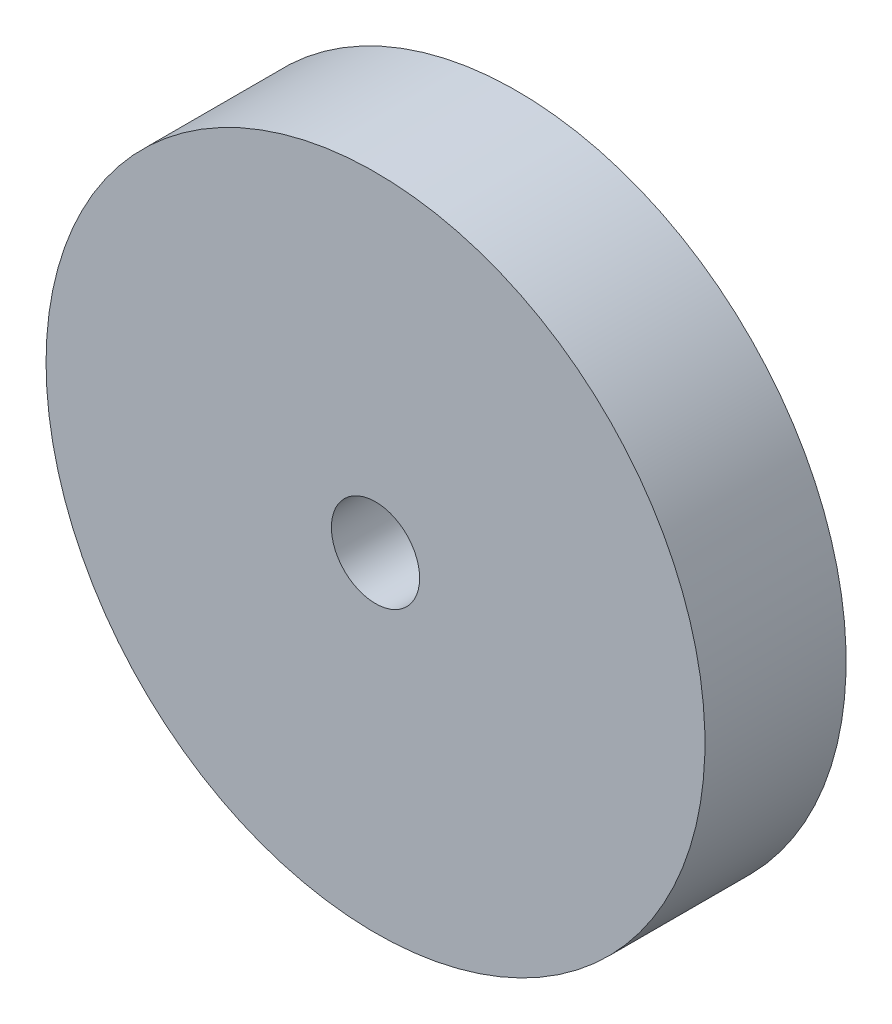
ISO-10303-21;
HEADER;
FILE_DESCRIPTION(('STEP AP214'),'2;1');
FILE_NAME('part.step','',(''),(''),'','','');
FILE_SCHEMA(('AUTOMOTIVE_DESIGN { 1 0 10303 214 1 1 1 1 }'));
ENDSEC;
DATA;
#1=APPLICATION_CONTEXT('core data for automotive mechanical design processes');
#2=APPLICATION_PROTOCOL_DEFINITION('international standard','automotive_design',2000,#1);
#3=PRODUCT_CONTEXT('',#1,'mechanical');
#4=PRODUCT('Part','Part','',(#3));
#5=PRODUCT_RELATED_PRODUCT_CATEGORY('part','',(#4));
#6=PRODUCT_DEFINITION_FORMATION('','',#4);
#7=PRODUCT_DEFINITION_CONTEXT('part definition',#1,'design');
#8=PRODUCT_DEFINITION('design','',#6,#7);
#9=PRODUCT_DEFINITION_SHAPE('','',#8);
#10=(LENGTH_UNIT() NAMED_UNIT(*) SI_UNIT(.MILLI.,.METRE.));
#11=(NAMED_UNIT(*) PLANE_ANGLE_UNIT() SI_UNIT($,.RADIAN.));
#12=(NAMED_UNIT(*) SI_UNIT($,.STERADIAN.) SOLID_ANGLE_UNIT());
#13=UNCERTAINTY_MEASURE_WITH_UNIT(LENGTH_MEASURE(1.E-05),#10,'distance_accuracy_value','');
#14=(GEOMETRIC_REPRESENTATION_CONTEXT(3) GLOBAL_UNCERTAINTY_ASSIGNED_CONTEXT((#13)) GLOBAL_UNIT_ASSIGNED_CONTEXT((#10,
#11,#12)) REPRESENTATION_CONTEXT('',''));
#15=CARTESIAN_POINT('',(0.,0.,0.));
#16=DIRECTION('',(0.,0.,1.));
#17=DIRECTION('',(1.,0.,0.));
#18=AXIS2_PLACEMENT_3D('',#15,#16,#17);
#19=CARTESIAN_POINT('',(30.9534203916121,4.22124096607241,402.217440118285));
#20=DIRECTION('',(0.,0.,-1.));
#21=DIRECTION('',(-1.,0.,0.));
#22=AXIS2_PLACEMENT_3D('',#19,#20,#21);
#23=CYLINDRICAL_SURFACE('',#22,22.225);
#24=CARTESIAN_POINT('',(30.9534203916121,4.22124096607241,402.217440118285));
#25=DIRECTION('',(0.,0.,1.));
#26=DIRECTION('',(1.,0.,0.));
#27=AXIS2_PLACEMENT_3D('',#24,#25,#26);
#28=CIRCLE('',#27,22.225);
#29=CARTESIAN_POINT('',(8.72842039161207,4.22124096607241,402.217440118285));
#30=VERTEX_POINT('',#29);
#31=EDGE_CURVE('E10',#30,#30,#28,.T.);
#32=CARTESIAN_POINT('',(30.9534203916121,4.22124096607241,392.692440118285));
#33=DIRECTION('',(0.,0.,1.));
#34=DIRECTION('',(1.,0.,0.));
#35=AXIS2_PLACEMENT_3D('',#32,#33,#34);
#36=CIRCLE('',#35,22.225);
#37=CARTESIAN_POINT('',(8.72842039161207,4.22124096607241,392.692440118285));
#38=VERTEX_POINT('',#37);
#39=EDGE_CURVE('E34',#38,#38,#36,.T.);
#40=CARTESIAN_POINT('',(8.72842039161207,4.22124096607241,402.217440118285));
#41=CARTESIAN_POINT('',(8.72842039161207,4.22124096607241,402.118221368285));
#42=CARTESIAN_POINT('',(8.72842039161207,4.22124096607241,402.019002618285));
#43=CARTESIAN_POINT('',(8.72842039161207,4.22124096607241,401.820565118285));
#44=CARTESIAN_POINT('',(8.72842039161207,4.22124096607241,401.721346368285));
#45=CARTESIAN_POINT('',(8.72842039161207,4.22124096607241,401.522908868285));
#46=CARTESIAN_POINT('',(8.72842039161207,4.22124096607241,401.423690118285));
#47=CARTESIAN_POINT('',(8.72842039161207,4.22124096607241,401.225252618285));
#48=CARTESIAN_POINT('',(8.72842039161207,4.22124096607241,401.126033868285));
#49=CARTESIAN_POINT('',(8.72842039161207,4.22124096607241,400.927596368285));
#50=CARTESIAN_POINT('',(8.72842039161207,4.22124096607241,400.828377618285));
#51=CARTESIAN_POINT('',(8.72842039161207,4.22124096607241,400.629940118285));
#52=CARTESIAN_POINT('',(8.72842039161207,4.22124096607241,400.530721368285));
#53=CARTESIAN_POINT('',(8.72842039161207,4.22124096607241,400.332283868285));
#54=CARTESIAN_POINT('',(8.72842039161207,4.22124096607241,400.233065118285));
#55=CARTESIAN_POINT('',(8.72842039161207,4.22124096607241,400.034627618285));
#56=CARTESIAN_POINT('',(8.72842039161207,4.22124096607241,399.935408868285));
#57=CARTESIAN_POINT('',(8.72842039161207,4.22124096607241,399.736971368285));
#58=CARTESIAN_POINT('',(8.72842039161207,4.22124096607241,399.637752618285));
#59=CARTESIAN_POINT('',(8.72842039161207,4.22124096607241,399.439315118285));
#60=CARTESIAN_POINT('',(8.72842039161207,4.22124096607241,399.340096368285));
#61=CARTESIAN_POINT('',(8.72842039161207,4.22124096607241,399.141658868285));
#62=CARTESIAN_POINT('',(8.72842039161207,4.22124096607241,399.042440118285));
#63=CARTESIAN_POINT('',(8.72842039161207,4.22124096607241,398.844002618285));
#64=CARTESIAN_POINT('',(8.72842039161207,4.22124096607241,398.744783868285));
#65=CARTESIAN_POINT('',(8.72842039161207,4.22124096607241,398.546346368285));
#66=CARTESIAN_POINT('',(8.72842039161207,4.22124096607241,398.447127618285));
#67=CARTESIAN_POINT('',(8.72842039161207,4.22124096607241,398.248690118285));
#68=CARTESIAN_POINT('',(8.72842039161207,4.22124096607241,398.149471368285));
#69=CARTESIAN_POINT('',(8.72842039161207,4.22124096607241,397.951033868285));
#70=CARTESIAN_POINT('',(8.72842039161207,4.22124096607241,397.851815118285));
#71=CARTESIAN_POINT('',(8.72842039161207,4.22124096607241,397.653377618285));
#72=CARTESIAN_POINT('',(8.72842039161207,4.22124096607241,397.554158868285));
#73=CARTESIAN_POINT('',(8.72842039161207,4.22124096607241,397.355721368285));
#74=CARTESIAN_POINT('',(8.72842039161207,4.22124096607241,397.256502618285));
#75=CARTESIAN_POINT('',(8.72842039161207,4.22124096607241,397.058065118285));
#76=CARTESIAN_POINT('',(8.72842039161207,4.22124096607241,396.958846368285));
#77=CARTESIAN_POINT('',(8.72842039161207,4.22124096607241,396.760408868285));
#78=CARTESIAN_POINT('',(8.72842039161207,4.22124096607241,396.661190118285));
#79=CARTESIAN_POINT('',(8.72842039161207,4.22124096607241,396.462752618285));
#80=CARTESIAN_POINT('',(8.72842039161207,4.22124096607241,396.363533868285));
#81=CARTESIAN_POINT('',(8.72842039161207,4.22124096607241,396.165096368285));
#82=CARTESIAN_POINT('',(8.72842039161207,4.22124096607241,396.065877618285));
#83=CARTESIAN_POINT('',(8.72842039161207,4.22124096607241,395.867440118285));
#84=CARTESIAN_POINT('',(8.72842039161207,4.22124096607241,395.768221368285));
#85=CARTESIAN_POINT('',(8.72842039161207,4.22124096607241,395.569783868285));
#86=CARTESIAN_POINT('',(8.72842039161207,4.22124096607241,395.470565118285));
#87=CARTESIAN_POINT('',(8.72842039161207,4.22124096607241,395.272127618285));
#88=CARTESIAN_POINT('',(8.72842039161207,4.22124096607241,395.172908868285));
#89=CARTESIAN_POINT('',(8.72842039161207,4.22124096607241,394.974471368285));
#90=CARTESIAN_POINT('',(8.72842039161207,4.22124096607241,394.875252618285));
#91=CARTESIAN_POINT('',(8.72842039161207,4.22124096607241,394.676815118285));
#92=CARTESIAN_POINT('',(8.72842039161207,4.22124096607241,394.577596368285));
#93=CARTESIAN_POINT('',(8.72842039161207,4.22124096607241,394.379158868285));
#94=CARTESIAN_POINT('',(8.72842039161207,4.22124096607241,394.279940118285));
#95=CARTESIAN_POINT('',(8.72842039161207,4.22124096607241,394.081502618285));
#96=CARTESIAN_POINT('',(8.72842039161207,4.22124096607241,393.982283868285));
#97=CARTESIAN_POINT('',(8.72842039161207,4.22124096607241,393.783846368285));
#98=CARTESIAN_POINT('',(8.72842039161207,4.22124096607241,393.684627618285));
#99=CARTESIAN_POINT('',(8.72842039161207,4.22124096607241,393.486190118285));
#100=CARTESIAN_POINT('',(8.72842039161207,4.22124096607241,393.386971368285));
#101=CARTESIAN_POINT('',(8.72842039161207,4.22124096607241,393.188533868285));
#102=CARTESIAN_POINT('',(8.72842039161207,4.22124096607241,393.089315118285));
#103=CARTESIAN_POINT('',(8.72842039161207,4.22124096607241,392.890877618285));
#104=CARTESIAN_POINT('',(8.72842039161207,4.22124096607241,392.791658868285));
#105=CARTESIAN_POINT('',(8.72842039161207,4.22124096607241,392.692440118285));
#106=B_SPLINE_CURVE_WITH_KNOTS('',3,(#40,#41,#42,#43,#44,#45,#46,#47,#48,#49,#50,#51,#52,#53,
#54,#55,#56,#57,#58,#59,#60,#61,#62,#63,#64,#65,#66,#67,#68,#69,#70,#71,#72,#73,#74,#75,#76,#77,
#78,#79,#80,#81,#82,#83,#84,#85,#86,#87,#88,#89,#90,#91,#92,#93,#94,#95,#96,#97,#98,#99,#100,
#101,#102,#103,#104,#105),.UNSPECIFIED.,.F.,.F.,(4,2,2,2,2,2,2,2,2,2,2,2,2,2,2,2,2,2,2,2,2,2,2,
2,2,2,2,2,2,2,2,2,4),(0.,0.297656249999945,0.595312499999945,0.892968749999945,1.19062499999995,
1.48828124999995,1.78593749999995,2.08359374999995,2.38124999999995,2.67890624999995,
2.97656249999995,3.27421874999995,3.57187499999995,3.86953124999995,4.16718749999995,
4.46484374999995,4.76249999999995,5.06015624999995,5.35781249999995,5.65546874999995,
5.95312499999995,6.25078124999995,6.54843749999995,6.84609374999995,7.14374999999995,
7.44140624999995,7.73906249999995,8.03671874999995,8.33437499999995,8.63203124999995,
8.92968749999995,9.22734374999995,9.52499999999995),.UNSPECIFIED.);
#107=EDGE_CURVE('BSEAM31',#30,#38,#106,.T.);
#108=ORIENTED_EDGE('',*,*,#31,.F.);
#109=ORIENTED_EDGE('',*,*,#39,.T.);
#110=ORIENTED_EDGE('',*,*,#107,.T.);
#111=ORIENTED_EDGE('',*,*,#107,.F.);
#112=EDGE_LOOP('',(#108,#110,#109,#111));
#113=FACE_BOUND('',#112,.T.);
#114=ADVANCED_FACE('F31',(#113),#23,.T.);
#115=CARTESIAN_POINT('',(30.9534203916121,4.22124096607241,402.217440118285));
#116=DIRECTION('',(0.,0.,1.));
#117=DIRECTION('',(1.,0.,0.));
#118=AXIS2_PLACEMENT_3D('',#115,#116,#117);
#119=PLANE('',#118);
#120=CARTESIAN_POINT('',(30.9534203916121,4.22124096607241,402.217440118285));
#121=DIRECTION('',(0.,0.,1.));
#122=DIRECTION('',(1.,0.,0.));
#123=AXIS2_PLACEMENT_3D('',#120,#121,#122);
#124=CIRCLE('',#123,2.9765625);
#125=CARTESIAN_POINT('',(33.9299828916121,4.22124096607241,402.217440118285));
#126=VERTEX_POINT('',#125);
#127=EDGE_CURVE('E43',#126,#126,#124,.T.);
#128=ORIENTED_EDGE('',*,*,#127,.F.);
#129=EDGE_LOOP('',(#128));
#130=FACE_BOUND('',#129,.T.);
#131=ORIENTED_EDGE('',*,*,#31,.T.);
#132=EDGE_LOOP('',(#131));
#133=FACE_BOUND('',#132,.T.);
#134=ADVANCED_FACE('F58',(#130,#133),#119,.T.);
#135=CARTESIAN_POINT('',(30.9534203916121,4.22124096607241,392.692440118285));
#136=DIRECTION('',(0.,0.,1.));
#137=DIRECTION('',(1.,0.,0.));
#138=AXIS2_PLACEMENT_3D('',#135,#136,#137);
#139=PLANE('',#138);
#140=CARTESIAN_POINT('',(30.9534203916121,4.22124096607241,392.692440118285));
#141=DIRECTION('',(0.,0.,1.));
#142=DIRECTION('',(1.,0.,0.));
#143=AXIS2_PLACEMENT_3D('',#140,#141,#142);
#144=CIRCLE('',#143,2.9765625);
#145=CARTESIAN_POINT('',(33.9299828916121,4.22124096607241,392.692440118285));
#146=VERTEX_POINT('',#145);
#147=EDGE_CURVE('E41',#146,#146,#144,.T.);
#148=ORIENTED_EDGE('',*,*,#147,.T.);
#149=EDGE_LOOP('',(#148));
#150=FACE_BOUND('',#149,.T.);
#151=ORIENTED_EDGE('',*,*,#39,.F.);
#152=EDGE_LOOP('',(#151));
#153=FACE_BOUND('',#152,.T.);
#154=ADVANCED_FACE('F49',(#150,#153),#139,.F.);
#155=CARTESIAN_POINT('',(30.9534203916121,4.22124096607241,392.692440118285));
#156=DIRECTION('',(0.,0.,1.));
#157=DIRECTION('',(1.,0.,0.));
#158=AXIS2_PLACEMENT_3D('',#155,#156,#157);
#159=CYLINDRICAL_SURFACE('',#158,2.9765625);
#160=CARTESIAN_POINT('',(33.9299828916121,4.22124096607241,392.692440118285));
#161=CARTESIAN_POINT('',(33.9299828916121,4.22124096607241,392.791658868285));
#162=CARTESIAN_POINT('',(33.9299828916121,4.22124096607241,392.890877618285));
#163=CARTESIAN_POINT('',(33.9299828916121,4.22124096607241,393.089315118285));
#164=CARTESIAN_POINT('',(33.9299828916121,4.22124096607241,393.188533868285));
#165=CARTESIAN_POINT('',(33.9299828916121,4.22124096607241,393.386971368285));
#166=CARTESIAN_POINT('',(33.9299828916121,4.22124096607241,393.486190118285));
#167=CARTESIAN_POINT('',(33.9299828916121,4.22124096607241,393.684627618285));
#168=CARTESIAN_POINT('',(33.9299828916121,4.22124096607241,393.783846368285));
#169=CARTESIAN_POINT('',(33.9299828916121,4.22124096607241,393.982283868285));
#170=CARTESIAN_POINT('',(33.9299828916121,4.22124096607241,394.081502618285));
#171=CARTESIAN_POINT('',(33.9299828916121,4.22124096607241,394.279940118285));
#172=CARTESIAN_POINT('',(33.9299828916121,4.22124096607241,394.379158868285));
#173=CARTESIAN_POINT('',(33.9299828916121,4.22124096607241,394.577596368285));
#174=CARTESIAN_POINT('',(33.9299828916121,4.22124096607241,394.676815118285));
#175=CARTESIAN_POINT('',(33.9299828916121,4.22124096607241,394.875252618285));
#176=CARTESIAN_POINT('',(33.9299828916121,4.22124096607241,394.974471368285));
#177=CARTESIAN_POINT('',(33.9299828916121,4.22124096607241,395.172908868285));
#178=CARTESIAN_POINT('',(33.9299828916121,4.22124096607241,395.272127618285));
#179=CARTESIAN_POINT('',(33.9299828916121,4.22124096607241,395.470565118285));
#180=CARTESIAN_POINT('',(33.9299828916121,4.22124096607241,395.569783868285));
#181=CARTESIAN_POINT('',(33.9299828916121,4.22124096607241,395.768221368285));
#182=CARTESIAN_POINT('',(33.9299828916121,4.22124096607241,395.867440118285));
#183=CARTESIAN_POINT('',(33.9299828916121,4.22124096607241,396.065877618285));
#184=CARTESIAN_POINT('',(33.9299828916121,4.22124096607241,396.165096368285));
#185=CARTESIAN_POINT('',(33.9299828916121,4.22124096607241,396.363533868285));
#186=CARTESIAN_POINT('',(33.9299828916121,4.22124096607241,396.462752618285));
#187=CARTESIAN_POINT('',(33.9299828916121,4.22124096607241,396.661190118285));
#188=CARTESIAN_POINT('',(33.9299828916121,4.22124096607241,396.760408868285));
#189=CARTESIAN_POINT('',(33.9299828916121,4.22124096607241,396.958846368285));
#190=CARTESIAN_POINT('',(33.9299828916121,4.22124096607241,397.058065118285));
#191=CARTESIAN_POINT('',(33.9299828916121,4.22124096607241,397.256502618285));
#192=CARTESIAN_POINT('',(33.9299828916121,4.22124096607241,397.355721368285));
#193=CARTESIAN_POINT('',(33.9299828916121,4.22124096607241,397.554158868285));
#194=CARTESIAN_POINT('',(33.9299828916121,4.22124096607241,397.653377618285));
#195=CARTESIAN_POINT('',(33.9299828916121,4.22124096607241,397.851815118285));
#196=CARTESIAN_POINT('',(33.9299828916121,4.22124096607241,397.951033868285));
#197=CARTESIAN_POINT('',(33.9299828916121,4.22124096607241,398.149471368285));
#198=CARTESIAN_POINT('',(33.9299828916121,4.22124096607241,398.248690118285));
#199=CARTESIAN_POINT('',(33.9299828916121,4.22124096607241,398.447127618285));
#200=CARTESIAN_POINT('',(33.9299828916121,4.22124096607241,398.546346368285));
#201=CARTESIAN_POINT('',(33.9299828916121,4.22124096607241,398.744783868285));
#202=CARTESIAN_POINT('',(33.9299828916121,4.22124096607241,398.844002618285));
#203=CARTESIAN_POINT('',(33.9299828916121,4.22124096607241,399.042440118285));
#204=CARTESIAN_POINT('',(33.9299828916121,4.22124096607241,399.141658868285));
#205=CARTESIAN_POINT('',(33.9299828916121,4.22124096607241,399.340096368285));
#206=CARTESIAN_POINT('',(33.9299828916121,4.22124096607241,399.439315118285));
#207=CARTESIAN_POINT('',(33.9299828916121,4.22124096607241,399.637752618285));
#208=CARTESIAN_POINT('',(33.9299828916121,4.22124096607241,399.736971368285));
#209=CARTESIAN_POINT('',(33.9299828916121,4.22124096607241,399.935408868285));
#210=CARTESIAN_POINT('',(33.9299828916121,4.22124096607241,400.034627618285));
#211=CARTESIAN_POINT('',(33.9299828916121,4.22124096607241,400.233065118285));
#212=CARTESIAN_POINT('',(33.9299828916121,4.22124096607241,400.332283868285));
#213=CARTESIAN_POINT('',(33.9299828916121,4.22124096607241,400.530721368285));
#214=CARTESIAN_POINT('',(33.9299828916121,4.22124096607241,400.629940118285));
#215=CARTESIAN_POINT('',(33.9299828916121,4.22124096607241,400.828377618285));
#216=CARTESIAN_POINT('',(33.9299828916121,4.22124096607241,400.927596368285));
#217=CARTESIAN_POINT('',(33.9299828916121,4.22124096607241,401.126033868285));
#218=CARTESIAN_POINT('',(33.9299828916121,4.22124096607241,401.225252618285));
#219=CARTESIAN_POINT('',(33.9299828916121,4.22124096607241,401.423690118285));
#220=CARTESIAN_POINT('',(33.9299828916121,4.22124096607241,401.522908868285));
#221=CARTESIAN_POINT('',(33.9299828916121,4.22124096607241,401.721346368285));
#222=CARTESIAN_POINT('',(33.9299828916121,4.22124096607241,401.820565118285));
#223=CARTESIAN_POINT('',(33.9299828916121,4.22124096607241,402.019002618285));
#224=CARTESIAN_POINT('',(33.9299828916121,4.22124096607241,402.118221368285));
#225=CARTESIAN_POINT('',(33.9299828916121,4.22124096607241,402.217440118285));
#226=B_SPLINE_CURVE_WITH_KNOTS('',3,(#160,#161,#162,#163,#164,#165,#166,#167,#168,#169,#170,
#171,#172,#173,#174,#175,#176,#177,#178,#179,#180,#181,#182,#183,#184,#185,#186,#187,#188,#189,
#190,#191,#192,#193,#194,#195,#196,#197,#198,#199,#200,#201,#202,#203,#204,#205,#206,#207,#208,
#209,#210,#211,#212,#213,#214,#215,#216,#217,#218,#219,#220,#221,#222,#223,#224,#225),
.UNSPECIFIED.,.F.,.F.,(4,2,2,2,2,2,2,2,2,2,2,2,2,2,2,2,2,2,2,2,2,2,2,2,2,2,2,2,2,2,2,2,4),(0.,
0.29765625,0.5953125,0.892968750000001,1.190625,1.48828125,1.7859375,2.08359375,2.38125,
2.67890625,2.9765625,3.27421875,3.571875,3.86953125,4.1671875,4.46484375,4.7625,5.06015625,
5.3578125,5.65546875,5.953125,6.25078125,6.5484375,6.84609375,7.14375,7.44140625,7.7390625,
8.03671875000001,8.334375,8.63203125,8.92968750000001,9.22734375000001,9.52500000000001),.UNSPECIFIED.);
#227=EDGE_CURVE('BSEAM52',#146,#126,#226,.T.);
#228=ORIENTED_EDGE('',*,*,#147,.F.);
#229=ORIENTED_EDGE('',*,*,#127,.T.);
#230=ORIENTED_EDGE('',*,*,#227,.T.);
#231=ORIENTED_EDGE('',*,*,#227,.F.);
#232=EDGE_LOOP('',(#228,#230,#229,#231));
#233=FACE_BOUND('',#232,.T.);
#234=ADVANCED_FACE('F52',(#233),#159,.F.);
#235=CLOSED_SHELL('',(#114,#134,#154,#234));
#236=MANIFOLD_SOLID_BREP('B2',#235);
#237=ADVANCED_BREP_SHAPE_REPRESENTATION('',(#18,#236),#14);
#238=SHAPE_DEFINITION_REPRESENTATION(#9,#237);
ENDSEC;
END-ISO-10303-21;
